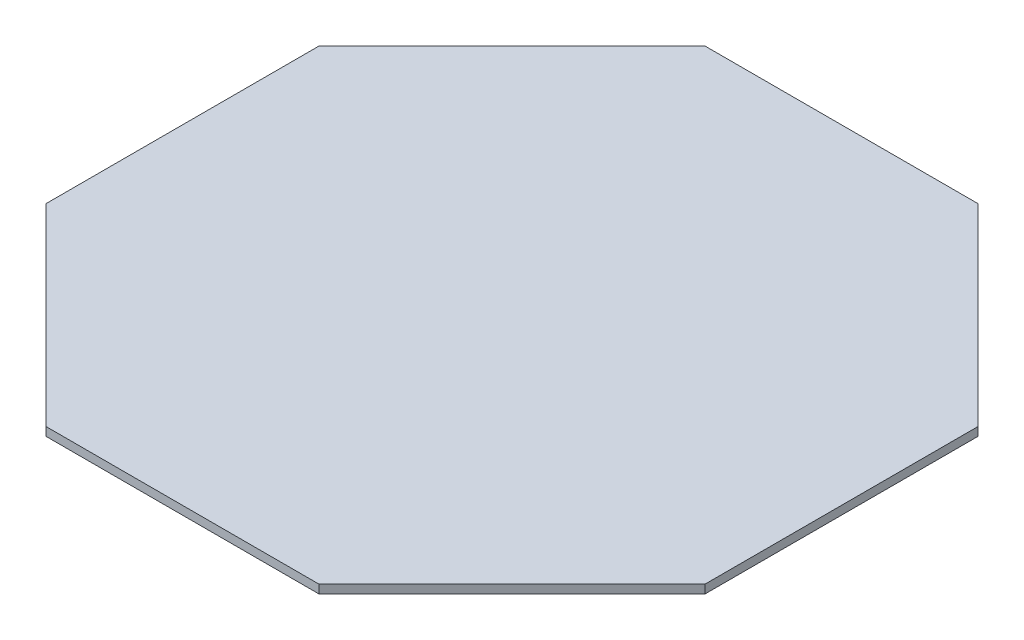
ISO-10303-21;
HEADER;
FILE_DESCRIPTION(('STEP AP214'),'2;1');
FILE_NAME('part.step','',(''),(''),'','','');
FILE_SCHEMA(('AUTOMOTIVE_DESIGN { 1 0 10303 214 1 1 1 1 }'));
ENDSEC;
DATA;
#1=APPLICATION_CONTEXT('core data for automotive mechanical design processes');
#2=APPLICATION_PROTOCOL_DEFINITION('international standard','automotive_design',2000,#1);
#3=PRODUCT_CONTEXT('',#1,'mechanical');
#4=PRODUCT('Part','Part','',(#3));
#5=PRODUCT_RELATED_PRODUCT_CATEGORY('part','',(#4));
#6=PRODUCT_DEFINITION_FORMATION('','',#4);
#7=PRODUCT_DEFINITION_CONTEXT('part definition',#1,'design');
#8=PRODUCT_DEFINITION('design','',#6,#7);
#9=PRODUCT_DEFINITION_SHAPE('','',#8);
#10=(LENGTH_UNIT() NAMED_UNIT(*) SI_UNIT(.MILLI.,.METRE.));
#11=(NAMED_UNIT(*) PLANE_ANGLE_UNIT() SI_UNIT($,.RADIAN.));
#12=(NAMED_UNIT(*) SI_UNIT($,.STERADIAN.) SOLID_ANGLE_UNIT());
#13=UNCERTAINTY_MEASURE_WITH_UNIT(LENGTH_MEASURE(1.E-05),#10,'distance_accuracy_value','');
#14=(GEOMETRIC_REPRESENTATION_CONTEXT(3) GLOBAL_UNCERTAINTY_ASSIGNED_CONTEXT((#13)) GLOBAL_UNIT_ASSIGNED_CONTEXT((#10,
#11,#12)) REPRESENTATION_CONTEXT('',''));
#15=CARTESIAN_POINT('',(0.,0.,0.));
#16=DIRECTION('',(0.,0.,1.));
#17=DIRECTION('',(1.,0.,0.));
#18=AXIS2_PLACEMENT_3D('',#15,#16,#17);
#19=CARTESIAN_POINT('',(-76.2000000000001,4.7625,183.96307345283));
#20=DIRECTION('',(0.,0.,-1.));
#21=DIRECTION('',(-1.,0.,0.));
#22=AXIS2_PLACEMENT_3D('',#19,#20,#21);
#23=PLANE('',#22);
#24=DIRECTION('',(1.,0.,0.));
#25=VECTOR('',#24,1.);
#26=CARTESIAN_POINT('',(-76.2000000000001,0.,183.96307345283));
#27=LINE('',#26,#25);
#28=CARTESIAN_POINT('',(-76.2000000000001,0.,183.96307345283));
#29=VERTEX_POINT('',#28);
#30=CARTESIAN_POINT('',(76.2,0.,183.96307345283));
#31=VERTEX_POINT('',#30);
#32=EDGE_CURVE('E144',#29,#31,#27,.T.);
#33=ORIENTED_EDGE('',*,*,#32,.T.);
#34=DIRECTION('',(0.,-1.,0.));
#35=VECTOR('',#34,1.);
#36=CARTESIAN_POINT('',(76.2,4.7625,183.96307345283));
#37=LINE('',#36,#35);
#38=CARTESIAN_POINT('',(76.2,4.7625,183.96307345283));
#39=VERTEX_POINT('',#38);
#40=EDGE_CURVE('E11',#39,#31,#37,.T.);
#41=ORIENTED_EDGE('',*,*,#40,.F.);
#42=DIRECTION('',(1.,0.,0.));
#43=VECTOR('',#42,1.);
#44=CARTESIAN_POINT('',(-76.2000000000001,4.7625,183.96307345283));
#45=LINE('',#44,#43);
#46=CARTESIAN_POINT('',(-76.2000000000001,4.7625,183.96307345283));
#47=VERTEX_POINT('',#46);
#48=EDGE_CURVE('E166',#47,#39,#45,.T.);
#49=ORIENTED_EDGE('',*,*,#48,.F.);
#50=DIRECTION('',(0.,-1.,0.));
#51=VECTOR('',#50,1.);
#52=CARTESIAN_POINT('',(-76.2000000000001,4.7625,183.96307345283));
#53=LINE('',#52,#51);
#54=EDGE_CURVE('E140',#47,#29,#53,.T.);
#55=ORIENTED_EDGE('',*,*,#54,.T.);
#56=EDGE_LOOP('',(#33,#41,#49,#55));
#57=FACE_BOUND('',#56,.T.);
#58=ADVANCED_FACE('F43',(#57),#23,.F.);
#59=CARTESIAN_POINT('',(76.2,4.7625,183.96307345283));
#60=DIRECTION('',(-0.707106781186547,0.,-0.707106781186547));
#61=DIRECTION('',(-0.707106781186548,0.,0.707106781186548));
#62=AXIS2_PLACEMENT_3D('',#59,#60,#61);
#63=PLANE('',#62);
#64=DIRECTION('',(0.707106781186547,0.,-0.707106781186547));
#65=VECTOR('',#64,1.);
#66=CARTESIAN_POINT('',(76.2,0.,183.96307345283));
#67=LINE('',#66,#65);
#68=CARTESIAN_POINT('',(183.96307345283,0.,76.2));
#69=VERTEX_POINT('',#68);
#70=EDGE_CURVE('E148',#31,#69,#67,.T.);
#71=ORIENTED_EDGE('',*,*,#70,.T.);
#72=DIRECTION('',(0.,-1.,0.));
#73=VECTOR('',#72,1.);
#74=CARTESIAN_POINT('',(183.96307345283,4.7625,76.2));
#75=LINE('',#74,#73);
#76=CARTESIAN_POINT('',(183.96307345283,4.7625,76.2));
#77=VERTEX_POINT('',#76);
#78=EDGE_CURVE('E52',#77,#69,#75,.T.);
#79=ORIENTED_EDGE('',*,*,#78,.F.);
#80=DIRECTION('',(0.707106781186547,0.,-0.707106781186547));
#81=VECTOR('',#80,1.);
#82=CARTESIAN_POINT('',(76.2,4.7625,183.96307345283));
#83=LINE('',#82,#81);
#84=EDGE_CURVE('E103',#39,#77,#83,.T.);
#85=ORIENTED_EDGE('',*,*,#84,.F.);
#86=ORIENTED_EDGE('',*,*,#40,.T.);
#87=EDGE_LOOP('',(#71,#79,#85,#86));
#88=FACE_BOUND('',#87,.T.);
#89=ADVANCED_FACE('F212',(#88),#63,.F.);
#90=CARTESIAN_POINT('',(183.96307345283,4.7625,76.2));
#91=DIRECTION('',(-1.,0.,0.));
#92=DIRECTION('',(0.,0.,1.));
#93=AXIS2_PLACEMENT_3D('',#90,#91,#92);
#94=PLANE('',#93);
#95=DIRECTION('',(0.,0.,-1.));
#96=VECTOR('',#95,1.);
#97=CARTESIAN_POINT('',(183.96307345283,0.,76.2));
#98=LINE('',#97,#96);
#99=CARTESIAN_POINT('',(183.96307345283,0.,-76.2000000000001));
#100=VERTEX_POINT('',#99);
#101=EDGE_CURVE('E151',#69,#100,#98,.T.);
#102=ORIENTED_EDGE('',*,*,#101,.T.);
#103=DIRECTION('',(0.,-1.,0.));
#104=VECTOR('',#103,1.);
#105=CARTESIAN_POINT('',(183.96307345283,4.7625,-76.2000000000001));
#106=LINE('',#105,#104);
#107=CARTESIAN_POINT('',(183.96307345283,4.7625,-76.2000000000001));
#108=VERTEX_POINT('',#107);
#109=EDGE_CURVE('E177',#108,#100,#106,.T.);
#110=ORIENTED_EDGE('',*,*,#109,.F.);
#111=DIRECTION('',(0.,0.,-1.));
#112=VECTOR('',#111,1.);
#113=CARTESIAN_POINT('',(183.96307345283,4.7625,76.2));
#114=LINE('',#113,#112);
#115=EDGE_CURVE('E187',#77,#108,#114,.T.);
#116=ORIENTED_EDGE('',*,*,#115,.F.);
#117=ORIENTED_EDGE('',*,*,#78,.T.);
#118=EDGE_LOOP('',(#102,#110,#116,#117));
#119=FACE_BOUND('',#118,.T.);
#120=ADVANCED_FACE('F185',(#119),#94,.F.);
#121=CARTESIAN_POINT('',(183.96307345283,4.7625,-76.2000000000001));
#122=DIRECTION('',(-0.707106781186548,0.,0.707106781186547));
#123=DIRECTION('',(0.707106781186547,0.,0.707106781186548));
#124=AXIS2_PLACEMENT_3D('',#121,#122,#123);
#125=PLANE('',#124);
#126=DIRECTION('',(-0.707106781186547,0.,-0.707106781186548));
#127=VECTOR('',#126,1.);
#128=CARTESIAN_POINT('',(183.96307345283,0.,-76.2000000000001));
#129=LINE('',#128,#127);
#130=CARTESIAN_POINT('',(76.2000000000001,0.,-183.96307345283));
#131=VERTEX_POINT('',#130);
#132=EDGE_CURVE('E154',#100,#131,#129,.T.);
#133=ORIENTED_EDGE('',*,*,#132,.T.);
#134=DIRECTION('',(0.,-1.,0.));
#135=VECTOR('',#134,1.);
#136=CARTESIAN_POINT('',(76.2000000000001,4.7625,-183.96307345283));
#137=LINE('',#136,#135);
#138=CARTESIAN_POINT('',(76.2000000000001,4.7625,-183.96307345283));
#139=VERTEX_POINT('',#138);
#140=EDGE_CURVE('E173',#139,#131,#137,.T.);
#141=ORIENTED_EDGE('',*,*,#140,.F.);
#142=DIRECTION('',(-0.707106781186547,0.,-0.707106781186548));
#143=VECTOR('',#142,1.);
#144=CARTESIAN_POINT('',(183.96307345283,4.7625,-76.2000000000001));
#145=LINE('',#144,#143);
#146=EDGE_CURVE('E200',#108,#139,#145,.T.);
#147=ORIENTED_EDGE('',*,*,#146,.F.);
#148=ORIENTED_EDGE('',*,*,#109,.T.);
#149=EDGE_LOOP('',(#133,#141,#147,#148));
#150=FACE_BOUND('',#149,.T.);
#151=ADVANCED_FACE('F195',(#150),#125,.F.);
#152=CARTESIAN_POINT('',(76.2000000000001,4.7625,-183.96307345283));
#153=DIRECTION('',(0.,0.,1.));
#154=DIRECTION('',(1.,0.,0.));
#155=AXIS2_PLACEMENT_3D('',#152,#153,#154);
#156=PLANE('',#155);
#157=DIRECTION('',(-1.,0.,0.));
#158=VECTOR('',#157,1.);
#159=CARTESIAN_POINT('',(76.2000000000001,0.,-183.96307345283));
#160=LINE('',#159,#158);
#161=CARTESIAN_POINT('',(-76.2000000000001,0.,-183.96307345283));
#162=VERTEX_POINT('',#161);
#163=EDGE_CURVE('E157',#131,#162,#160,.T.);
#164=ORIENTED_EDGE('',*,*,#163,.T.);
#165=DIRECTION('',(0.,-1.,0.));
#166=VECTOR('',#165,1.);
#167=CARTESIAN_POINT('',(-76.2000000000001,4.7625,-183.96307345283));
#168=LINE('',#167,#166);
#169=CARTESIAN_POINT('',(-76.2000000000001,4.7625,-183.96307345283));
#170=VERTEX_POINT('',#169);
#171=EDGE_CURVE('E133',#170,#162,#168,.T.);
#172=ORIENTED_EDGE('',*,*,#171,.F.);
#173=DIRECTION('',(-1.,0.,0.));
#174=VECTOR('',#173,1.);
#175=CARTESIAN_POINT('',(76.2000000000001,4.7625,-183.96307345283));
#176=LINE('',#175,#174);
#177=EDGE_CURVE('E122',#139,#170,#176,.T.);
#178=ORIENTED_EDGE('',*,*,#177,.F.);
#179=ORIENTED_EDGE('',*,*,#140,.T.);
#180=EDGE_LOOP('',(#164,#172,#178,#179));
#181=FACE_BOUND('',#180,.T.);
#182=ADVANCED_FACE('F198',(#181),#156,.F.);
#183=CARTESIAN_POINT('',(-76.2000000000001,4.7625,-183.96307345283));
#184=DIRECTION('',(0.707106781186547,0.,0.707106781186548));
#185=DIRECTION('',(0.707106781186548,0.,-0.707106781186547));
#186=AXIS2_PLACEMENT_3D('',#183,#184,#185);
#187=PLANE('',#186);
#188=DIRECTION('',(-0.707106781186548,0.,0.707106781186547));
#189=VECTOR('',#188,1.);
#190=CARTESIAN_POINT('',(-76.2000000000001,0.,-183.96307345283));
#191=LINE('',#190,#189);
#192=CARTESIAN_POINT('',(-183.96307345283,0.,-76.2000000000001));
#193=VERTEX_POINT('',#192);
#194=EDGE_CURVE('E131',#162,#193,#191,.T.);
#195=ORIENTED_EDGE('',*,*,#194,.T.);
#196=DIRECTION('',(0.,-1.,0.));
#197=VECTOR('',#196,1.);
#198=CARTESIAN_POINT('',(-183.96307345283,4.7625,-76.2000000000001));
#199=LINE('',#198,#197);
#200=CARTESIAN_POINT('',(-183.96307345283,4.7625,-76.2000000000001));
#201=VERTEX_POINT('',#200);
#202=EDGE_CURVE('E128',#201,#193,#199,.T.);
#203=ORIENTED_EDGE('',*,*,#202,.F.);
#204=DIRECTION('',(-0.707106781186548,0.,0.707106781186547));
#205=VECTOR('',#204,1.);
#206=CARTESIAN_POINT('',(-76.2000000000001,4.7625,-183.96307345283));
#207=LINE('',#206,#205);
#208=EDGE_CURVE('E116',#170,#201,#207,.T.);
#209=ORIENTED_EDGE('',*,*,#208,.F.);
#210=ORIENTED_EDGE('',*,*,#171,.T.);
#211=EDGE_LOOP('',(#195,#203,#209,#210));
#212=FACE_BOUND('',#211,.T.);
#213=ADVANCED_FACE('F129',(#212),#187,.F.);
#214=CARTESIAN_POINT('',(-183.96307345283,4.7625,-76.2000000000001));
#215=DIRECTION('',(1.,0.,0.));
#216=DIRECTION('',(0.,0.,-1.));
#217=AXIS2_PLACEMENT_3D('',#214,#215,#216);
#218=PLANE('',#217);
#219=DIRECTION('',(0.,0.,1.));
#220=VECTOR('',#219,1.);
#221=CARTESIAN_POINT('',(-183.96307345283,0.,-76.2000000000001));
#222=LINE('',#221,#220);
#223=CARTESIAN_POINT('',(-183.96307345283,0.,76.2));
#224=VERTEX_POINT('',#223);
#225=EDGE_CURVE('E89',#193,#224,#222,.T.);
#226=ORIENTED_EDGE('',*,*,#225,.T.);
#227=DIRECTION('',(0.,-1.,0.));
#228=VECTOR('',#227,1.);
#229=CARTESIAN_POINT('',(-183.96307345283,4.7625,76.2));
#230=LINE('',#229,#228);
#231=CARTESIAN_POINT('',(-183.96307345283,4.7625,76.2));
#232=VERTEX_POINT('',#231);
#233=EDGE_CURVE('E134',#232,#224,#230,.T.);
#234=ORIENTED_EDGE('',*,*,#233,.F.);
#235=DIRECTION('',(0.,0.,1.));
#236=VECTOR('',#235,1.);
#237=CARTESIAN_POINT('',(-183.96307345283,4.7625,-76.2000000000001));
#238=LINE('',#237,#236);
#239=EDGE_CURVE('E120',#201,#232,#238,.T.);
#240=ORIENTED_EDGE('',*,*,#239,.F.);
#241=ORIENTED_EDGE('',*,*,#202,.T.);
#242=EDGE_LOOP('',(#226,#234,#240,#241));
#243=FACE_BOUND('',#242,.T.);
#244=ADVANCED_FACE('F136',(#243),#218,.F.);
#245=CARTESIAN_POINT('',(-183.96307345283,4.7625,76.2));
#246=DIRECTION('',(0.707106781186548,0.,-0.707106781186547));
#247=DIRECTION('',(-0.707106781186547,0.,-0.707106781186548));
#248=AXIS2_PLACEMENT_3D('',#245,#246,#247);
#249=PLANE('',#248);
#250=DIRECTION('',(0.707106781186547,0.,0.707106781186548));
#251=VECTOR('',#250,1.);
#252=CARTESIAN_POINT('',(-183.96307345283,0.,76.2));
#253=LINE('',#252,#251);
#254=EDGE_CURVE('E95',#224,#29,#253,.T.);
#255=ORIENTED_EDGE('',*,*,#254,.T.);
#256=ORIENTED_EDGE('',*,*,#54,.F.);
#257=DIRECTION('',(0.707106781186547,0.,0.707106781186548));
#258=VECTOR('',#257,1.);
#259=CARTESIAN_POINT('',(-183.96307345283,4.7625,76.2));
#260=LINE('',#259,#258);
#261=EDGE_CURVE('E60',#232,#47,#260,.T.);
#262=ORIENTED_EDGE('',*,*,#261,.F.);
#263=ORIENTED_EDGE('',*,*,#233,.T.);
#264=EDGE_LOOP('',(#255,#256,#262,#263));
#265=FACE_BOUND('',#264,.T.);
#266=ADVANCED_FACE('F228',(#265),#249,.F.);
#267=CARTESIAN_POINT('',(0.,4.7625,0.));
#268=DIRECTION('',(0.,1.,0.));
#269=DIRECTION('',(0.,0.,1.));
#270=AXIS2_PLACEMENT_3D('',#267,#268,#269);
#271=PLANE('',#270);
#272=ORIENTED_EDGE('',*,*,#48,.T.);
#273=ORIENTED_EDGE('',*,*,#84,.T.);
#274=ORIENTED_EDGE('',*,*,#115,.T.);
#275=ORIENTED_EDGE('',*,*,#146,.T.);
#276=ORIENTED_EDGE('',*,*,#177,.T.);
#277=ORIENTED_EDGE('',*,*,#208,.T.);
#278=ORIENTED_EDGE('',*,*,#239,.T.);
#279=ORIENTED_EDGE('',*,*,#261,.T.);
#280=EDGE_LOOP('',(#272,#273,#274,#275,#276,#277,#278,#279));
#281=FACE_BOUND('',#280,.T.);
#282=ADVANCED_FACE('F118',(#281),#271,.T.);
#283=CARTESIAN_POINT('',(0.,0.,0.));
#284=DIRECTION('',(0.,1.,0.));
#285=DIRECTION('',(0.,0.,1.));
#286=AXIS2_PLACEMENT_3D('',#283,#284,#285);
#287=PLANE('',#286);
#288=ORIENTED_EDGE('',*,*,#32,.F.);
#289=ORIENTED_EDGE('',*,*,#254,.F.);
#290=ORIENTED_EDGE('',*,*,#225,.F.);
#291=ORIENTED_EDGE('',*,*,#194,.F.);
#292=ORIENTED_EDGE('',*,*,#163,.F.);
#293=ORIENTED_EDGE('',*,*,#132,.F.);
#294=ORIENTED_EDGE('',*,*,#101,.F.);
#295=ORIENTED_EDGE('',*,*,#70,.F.);
#296=EDGE_LOOP('',(#288,#289,#290,#291,#292,#293,#294,#295));
#297=FACE_BOUND('',#296,.T.);
#298=ADVANCED_FACE('F191',(#297),#287,.F.);
#299=CLOSED_SHELL('',(#58,#89,#120,#151,#182,#213,#244,#266,#282,#298));
#300=MANIFOLD_SOLID_BREP('B2',#299);
#301=ADVANCED_BREP_SHAPE_REPRESENTATION('',(#18,#300),#14);
#302=SHAPE_DEFINITION_REPRESENTATION(#9,#301);
ENDSEC;
END-ISO-10303-21;
